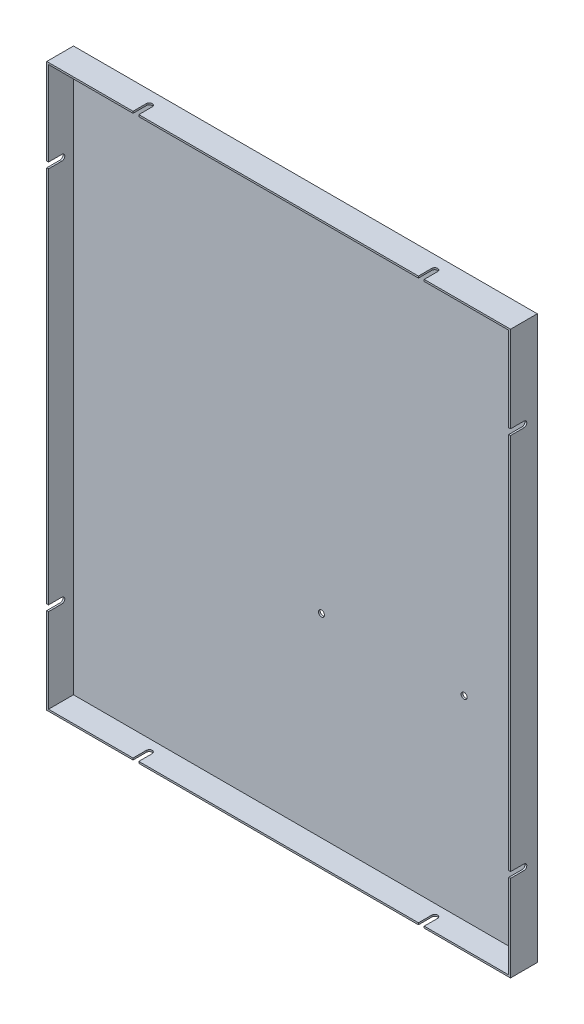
from build123d import *

# Parameters (mm, degrees)
SKETCH_1_W             = 520
SKETCH_1_H             = 630
EXTRUDE_1_DEPTH        = 30
SHELL_1_T              = -2
HOLE_WIZARD_M8_1_D     = 6.8
HOLE_WIZARD_M8_1_DEPTH = 19.75
HOLE_WIZARD_M8_1_TIP   = 2.042926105
CUT_EXTRUDE_1_DEPTH    = 818.435012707
CUT_EXTRUDE_2_DEPTH    = 818.435012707


with BuildPart() as part:
    # Sketch 1 → Extrude 1 (new body)
    with BuildSketch(Plane.XY):
        with Locations((260, -315)):
            Rectangle(SKETCH_1_W, SKETCH_1_H)
    extrude(amount=EXTRUDE_1_DEPTH)

    # Shell 1
    shell_1_openings = [part.faces().sort_by_distance(p)[0] for p in [
        (260, -315, 30),
    ]]
    offset(amount=SHELL_1_T, openings=shell_1_openings, kind=Kind.INTERSECTION)

    # Hole Wizard M8 _1
    with Locations(Plane.XY.offset(2)):
        with Locations((280, -410), (440, -410)):
            Hole(HOLE_WIZARD_M8_1_D / 2, depth=HOLE_WIZARD_M8_1_DEPTH)
            with Locations((0, 0, -(HOLE_WIZARD_M8_1_DEPTH + HOLE_WIZARD_M8_1_TIP / 2))):  # 118° drill point
                Cone(0, HOLE_WIZARD_M8_1_D / 2, HOLE_WIZARD_M8_1_TIP, mode=Mode.SUBTRACT)

    # Sketch 4 → Cut-Extrude 1 (cut, through all)
    with BuildSketch(Plane.ZY):
        with BuildLine():
            Line((30, -103.25), (15, -103.25))
            ThreePointArc((15, -103.25), (11.75, -100), (15, -96.75))
            Line((15, -96.75), (30, -96.75))
            ThreePointArc((30, -96.75), (33.25, -100), (30, -103.25))
        make_face()
        with BuildLine():
            Line((15, -526.75), (30, -526.75))
            ThreePointArc((30, -526.75), (33.25, -530), (30, -533.25))
            Line((30, -533.25), (15, -533.25))
            ThreePointArc((15, -533.25), (11.75, -530), (15, -526.75))
        make_face()
    extrude(amount=-CUT_EXTRUDE_1_DEPTH, mode=Mode.SUBTRACT)

    # Sketch 5 → Cut-Extrude 2 (cut, through all)
    with BuildSketch(Plane(origin=(0, 0, 0), x_dir=(1, 0, 0), z_dir=(0, 1, 0))):
        with BuildLine():
            Line((96.75, -30), (96.75, -15))
            ThreePointArc((96.75, -15), (100, -11.75), (103.25, -15))
            Line((103.25, -15), (103.25, -30))
            ThreePointArc((103.25, -30), (100, -33.25), (96.75, -30))
        make_face()
        with BuildLine():
            Line((416.75, -30), (416.75, -15))
            ThreePointArc((416.75, -15), (420, -11.75), (423.25, -15))
            Line((423.25, -15), (423.25, -30))
            ThreePointArc((423.25, -30), (420, -33.25), (416.75, -30))
        make_face()
    extrude(amount=-CUT_EXTRUDE_2_DEPTH, mode=Mode.SUBTRACT)


solid = part.part
